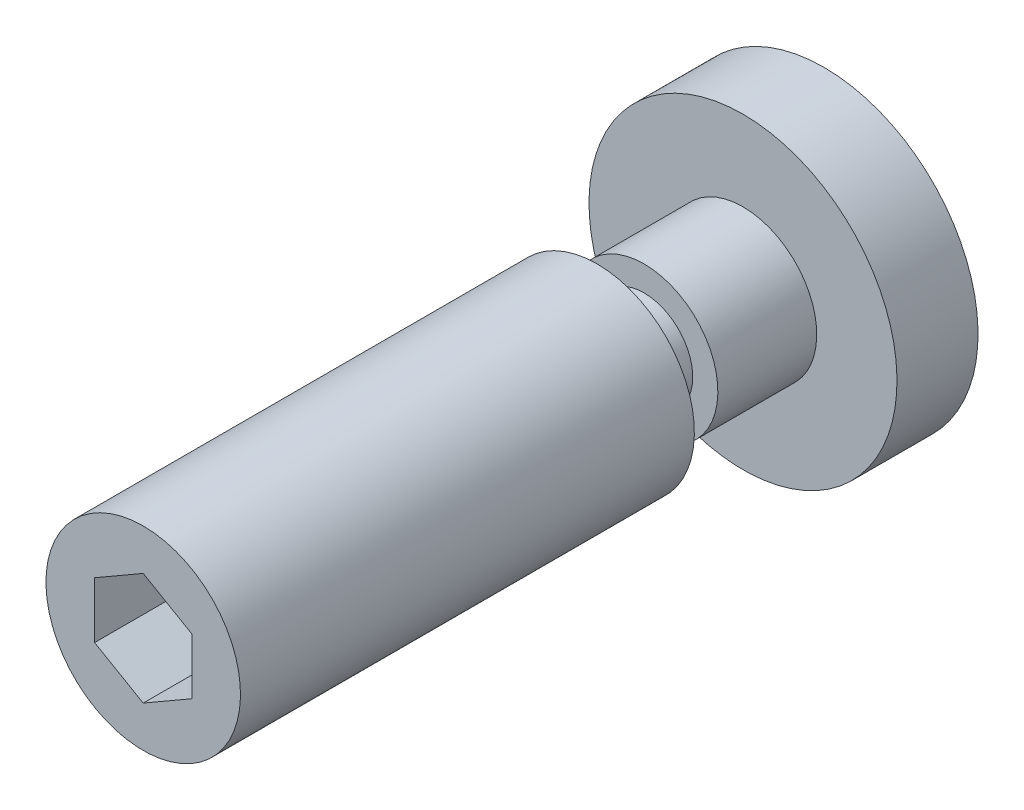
ISO-10303-21;
HEADER;
FILE_DESCRIPTION(('STEP AP214'),'2;1');
FILE_NAME('part.step','',(''),(''),'','','');
FILE_SCHEMA(('AUTOMOTIVE_DESIGN { 1 0 10303 214 1 1 1 1 }'));
ENDSEC;
DATA;
#1=APPLICATION_CONTEXT('core data for automotive mechanical design processes');
#2=APPLICATION_PROTOCOL_DEFINITION('international standard','automotive_design',2000,#1);
#3=PRODUCT_CONTEXT('',#1,'mechanical');
#4=PRODUCT('Part','Part','',(#3));
#5=PRODUCT_RELATED_PRODUCT_CATEGORY('part','',(#4));
#6=PRODUCT_DEFINITION_FORMATION('','',#4);
#7=PRODUCT_DEFINITION_CONTEXT('part definition',#1,'design');
#8=PRODUCT_DEFINITION('design','',#6,#7);
#9=PRODUCT_DEFINITION_SHAPE('','',#8);
#10=(LENGTH_UNIT() NAMED_UNIT(*) SI_UNIT(.MILLI.,.METRE.));
#11=(NAMED_UNIT(*) PLANE_ANGLE_UNIT() SI_UNIT($,.RADIAN.));
#12=(NAMED_UNIT(*) SI_UNIT($,.STERADIAN.) SOLID_ANGLE_UNIT());
#13=UNCERTAINTY_MEASURE_WITH_UNIT(LENGTH_MEASURE(1.E-05),#10,'distance_accuracy_value','');
#14=(GEOMETRIC_REPRESENTATION_CONTEXT(3) GLOBAL_UNCERTAINTY_ASSIGNED_CONTEXT((#13)) GLOBAL_UNIT_ASSIGNED_CONTEXT((#10,
#11,#12)) REPRESENTATION_CONTEXT('',''));
#15=CARTESIAN_POINT('',(0.,0.,0.));
#16=DIRECTION('',(0.,0.,1.));
#17=DIRECTION('',(1.,0.,0.));
#18=AXIS2_PLACEMENT_3D('',#15,#16,#17);
#19=CARTESIAN_POINT('',(0.,0.,0.));
#20=DIRECTION('',(0.,0.,1.));
#21=DIRECTION('',(0.,1.,0.));
#22=AXIS2_PLACEMENT_3D('',#19,#20,#21);
#23=PLANE('',#22);
#24=CARTESIAN_POINT('',(0.,0.,0.));
#25=DIRECTION('',(0.,0.,1.));
#26=DIRECTION('',(0.,1.,0.));
#27=AXIS2_PLACEMENT_3D('',#24,#25,#26);
#28=CIRCLE('',#27,9.5);
#29=CARTESIAN_POINT('',(0.,9.5,0.));
#30=VERTEX_POINT('',#29);
#31=EDGE_CURVE('E9',#30,#30,#28,.T.);
#32=ORIENTED_EDGE('',*,*,#31,.F.);
#33=EDGE_LOOP('',(#32));
#34=FACE_BOUND('',#33,.T.);
#35=ADVANCED_FACE('F14',(#34),#23,.F.);
#36=CARTESIAN_POINT('',(0.,0.,40.));
#37=DIRECTION('',(0.,0.,1.));
#38=DIRECTION('',(0.,1.,0.));
#39=AXIS2_PLACEMENT_3D('',#36,#37,#38);
#40=CYLINDRICAL_SURFACE('',#39,9.5);
#41=CARTESIAN_POINT('',(0.,0.,5.));
#42=DIRECTION('',(0.,0.,1.));
#43=DIRECTION('',(0.,1.,0.));
#44=AXIS2_PLACEMENT_3D('',#41,#42,#43);
#45=CIRCLE('',#44,9.5);
#46=CARTESIAN_POINT('',(0.,9.5,5.));
#47=VERTEX_POINT('',#46);
#48=EDGE_CURVE('E21',#47,#47,#45,.T.);
#49=ORIENTED_EDGE('',*,*,#48,.F.);
#50=EDGE_LOOP('',(#49));
#51=FACE_BOUND('',#50,.T.);
#52=ORIENTED_EDGE('',*,*,#31,.T.);
#53=EDGE_LOOP('',(#52));
#54=FACE_BOUND('',#53,.T.);
#55=ADVANCED_FACE('F142',(#51,#54),#40,.T.);
#56=CARTESIAN_POINT('',(0.,-9.5,5.));
#57=DIRECTION('',(0.,0.,-1.));
#58=DIRECTION('',(0.,-1.,0.));
#59=AXIS2_PLACEMENT_3D('',#56,#57,#58);
#60=PLANE('',#59);
#61=CARTESIAN_POINT('',(0.,0.,5.));
#62=DIRECTION('',(0.,0.,1.));
#63=DIRECTION('',(0.,1.,0.));
#64=AXIS2_PLACEMENT_3D('',#61,#62,#63);
#65=CIRCLE('',#64,4.55);
#66=CARTESIAN_POINT('',(0.,4.55,5.));
#67=VERTEX_POINT('',#66);
#68=EDGE_CURVE('E135',#67,#67,#65,.T.);
#69=ORIENTED_EDGE('',*,*,#68,.F.);
#70=EDGE_LOOP('',(#69));
#71=FACE_BOUND('',#70,.T.);
#72=ORIENTED_EDGE('',*,*,#48,.T.);
#73=EDGE_LOOP('',(#72));
#74=FACE_BOUND('',#73,.T.);
#75=ADVANCED_FACE('F140',(#71,#74),#60,.F.);
#76=CARTESIAN_POINT('',(0.,0.,40.));
#77=DIRECTION('',(0.,0.,1.));
#78=DIRECTION('',(0.,1.,0.));
#79=AXIS2_PLACEMENT_3D('',#76,#77,#78);
#80=CYLINDRICAL_SURFACE('',#79,4.55);
#81=CARTESIAN_POINT('',(0.,0.,11.1));
#82=DIRECTION('',(0.,0.,1.));
#83=DIRECTION('',(0.,1.,0.));
#84=AXIS2_PLACEMENT_3D('',#81,#82,#83);
#85=CIRCLE('',#84,4.55);
#86=CARTESIAN_POINT('',(0.,4.55,11.1));
#87=VERTEX_POINT('',#86);
#88=EDGE_CURVE('E132',#87,#87,#85,.T.);
#89=ORIENTED_EDGE('',*,*,#88,.F.);
#90=EDGE_LOOP('',(#89));
#91=FACE_BOUND('',#90,.T.);
#92=ORIENTED_EDGE('',*,*,#68,.T.);
#93=EDGE_LOOP('',(#92));
#94=FACE_BOUND('',#93,.T.);
#95=ADVANCED_FACE('F165',(#91,#94),#80,.T.);
#96=CARTESIAN_POINT('',(0.,-4.55,11.1));
#97=DIRECTION('',(0.,0.,-1.));
#98=DIRECTION('',(0.,-1.,0.));
#99=AXIS2_PLACEMENT_3D('',#96,#97,#98);
#100=PLANE('',#99);
#101=CARTESIAN_POINT('',(0.,0.,11.1));
#102=DIRECTION('',(0.,0.,1.));
#103=DIRECTION('',(0.,1.,0.));
#104=AXIS2_PLACEMENT_3D('',#101,#102,#103);
#105=CIRCLE('',#104,3.);
#106=CARTESIAN_POINT('',(0.,3.,11.1));
#107=VERTEX_POINT('',#106);
#108=EDGE_CURVE('E129',#107,#107,#105,.T.);
#109=ORIENTED_EDGE('',*,*,#108,.F.);
#110=EDGE_LOOP('',(#109));
#111=FACE_BOUND('',#110,.T.);
#112=ORIENTED_EDGE('',*,*,#88,.T.);
#113=EDGE_LOOP('',(#112));
#114=FACE_BOUND('',#113,.T.);
#115=ADVANCED_FACE('F174',(#111,#114),#100,.F.);
#116=CARTESIAN_POINT('',(0.,0.,40.));
#117=DIRECTION('',(0.,0.,1.));
#118=DIRECTION('',(0.,1.,0.));
#119=AXIS2_PLACEMENT_3D('',#116,#117,#118);
#120=CYLINDRICAL_SURFACE('',#119,3.);
#121=CARTESIAN_POINT('',(0.,0.,14.));
#122=DIRECTION('',(0.,0.,1.));
#123=DIRECTION('',(0.,1.,0.));
#124=AXIS2_PLACEMENT_3D('',#121,#122,#123);
#125=CIRCLE('',#124,3.);
#126=CARTESIAN_POINT('',(0.,3.,14.));
#127=VERTEX_POINT('',#126);
#128=EDGE_CURVE('E126',#127,#127,#125,.T.);
#129=ORIENTED_EDGE('',*,*,#128,.F.);
#130=EDGE_LOOP('',(#129));
#131=FACE_BOUND('',#130,.T.);
#132=ORIENTED_EDGE('',*,*,#108,.T.);
#133=EDGE_LOOP('',(#132));
#134=FACE_BOUND('',#133,.T.);
#135=ADVANCED_FACE('F183',(#131,#134),#120,.T.);
#136=CARTESIAN_POINT('',(0.,-3.,14.));
#137=DIRECTION('',(0.,0.,1.));
#138=DIRECTION('',(0.,1.,0.));
#139=AXIS2_PLACEMENT_3D('',#136,#137,#138);
#140=PLANE('',#139);
#141=CARTESIAN_POINT('',(0.,0.,14.));
#142=DIRECTION('',(0.,0.,1.));
#143=DIRECTION('',(0.,1.,0.));
#144=AXIS2_PLACEMENT_3D('',#141,#142,#143);
#145=CIRCLE('',#144,6.);
#146=CARTESIAN_POINT('',(0.,6.,14.));
#147=VERTEX_POINT('',#146);
#148=EDGE_CURVE('E123',#147,#147,#145,.T.);
#149=ORIENTED_EDGE('',*,*,#148,.F.);
#150=EDGE_LOOP('',(#149));
#151=FACE_BOUND('',#150,.T.);
#152=ORIENTED_EDGE('',*,*,#128,.T.);
#153=EDGE_LOOP('',(#152));
#154=FACE_BOUND('',#153,.T.);
#155=ADVANCED_FACE('F192',(#151,#154),#140,.F.);
#156=CARTESIAN_POINT('',(0.,0.,40.));
#157=DIRECTION('',(0.,0.,1.));
#158=DIRECTION('',(0.,1.,0.));
#159=AXIS2_PLACEMENT_3D('',#156,#157,#158);
#160=CYLINDRICAL_SURFACE('',#159,6.);
#161=CARTESIAN_POINT('',(0.,0.,42.));
#162=DIRECTION('',(0.,0.,1.));
#163=DIRECTION('',(0.,1.,0.));
#164=AXIS2_PLACEMENT_3D('',#161,#162,#163);
#165=CIRCLE('',#164,6.);
#166=CARTESIAN_POINT('',(0.,6.,42.));
#167=VERTEX_POINT('',#166);
#168=EDGE_CURVE('E115',#167,#167,#165,.T.);
#169=ORIENTED_EDGE('',*,*,#168,.F.);
#170=EDGE_LOOP('',(#169));
#171=FACE_BOUND('',#170,.T.);
#172=ORIENTED_EDGE('',*,*,#148,.T.);
#173=EDGE_LOOP('',(#172));
#174=FACE_BOUND('',#173,.T.);
#175=ADVANCED_FACE('F201',(#171,#174),#160,.T.);
#176=CARTESIAN_POINT('',(0.,-6.,42.));
#177=DIRECTION('',(0.,0.,-1.));
#178=DIRECTION('',(0.,-1.,0.));
#179=AXIS2_PLACEMENT_3D('',#176,#177,#178);
#180=PLANE('',#179);
#181=DIRECTION('',(-0.866025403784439,-0.5,0.));
#182=VECTOR('',#181,1.);
#183=CARTESIAN_POINT('',(0.,3.46410161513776,42.));
#184=LINE('',#183,#182);
#185=CARTESIAN_POINT('',(0.,3.46410161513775,42.));
#186=VERTEX_POINT('',#185);
#187=CARTESIAN_POINT('',(-3.,1.73205080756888,42.));
#188=VERTEX_POINT('',#187);
#189=EDGE_CURVE('E102',#186,#188,#184,.T.);
#190=ORIENTED_EDGE('',*,*,#189,.F.);
#191=DIRECTION('',(-0.866025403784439,0.5,0.));
#192=VECTOR('',#191,1.);
#193=CARTESIAN_POINT('',(3.,1.73205080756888,42.));
#194=LINE('',#193,#192);
#195=CARTESIAN_POINT('',(3.,1.73205080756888,42.));
#196=VERTEX_POINT('',#195);
#197=EDGE_CURVE('E28',#196,#186,#194,.T.);
#198=ORIENTED_EDGE('',*,*,#197,.F.);
#199=DIRECTION('',(0.,1.,0.));
#200=VECTOR('',#199,1.);
#201=CARTESIAN_POINT('',(3.,-1.73205080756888,42.));
#202=LINE('',#201,#200);
#203=CARTESIAN_POINT('',(3.,-1.73205080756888,42.));
#204=VERTEX_POINT('',#203);
#205=EDGE_CURVE('E111',#204,#196,#202,.T.);
#206=ORIENTED_EDGE('',*,*,#205,.F.);
#207=DIRECTION('',(0.866025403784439,0.5,0.));
#208=VECTOR('',#207,1.);
#209=CARTESIAN_POINT('',(0.,-3.46410161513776,42.));
#210=LINE('',#209,#208);
#211=CARTESIAN_POINT('',(0.,-3.46410161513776,42.));
#212=VERTEX_POINT('',#211);
#213=EDGE_CURVE('E109',#212,#204,#210,.T.);
#214=ORIENTED_EDGE('',*,*,#213,.F.);
#215=DIRECTION('',(0.866025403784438,-0.5,0.));
#216=VECTOR('',#215,1.);
#217=CARTESIAN_POINT('',(-3.,-1.73205080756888,42.));
#218=LINE('',#217,#216);
#219=CARTESIAN_POINT('',(-3.,-1.73205080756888,42.));
#220=VERTEX_POINT('',#219);
#221=EDGE_CURVE('E76',#220,#212,#218,.T.);
#222=ORIENTED_EDGE('',*,*,#221,.F.);
#223=DIRECTION('',(0.,-1.,0.));
#224=VECTOR('',#223,1.);
#225=CARTESIAN_POINT('',(-3.,1.73205080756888,42.));
#226=LINE('',#225,#224);
#227=EDGE_CURVE('E105',#188,#220,#226,.T.);
#228=ORIENTED_EDGE('',*,*,#227,.F.);
#229=EDGE_LOOP('',(#190,#198,#206,#214,#222,#228));
#230=FACE_BOUND('',#229,.T.);
#231=ORIENTED_EDGE('',*,*,#168,.T.);
#232=EDGE_LOOP('',(#231));
#233=FACE_BOUND('',#232,.T.);
#234=ADVANCED_FACE('F210',(#230,#233),#180,.F.);
#235=CARTESIAN_POINT('',(3.,1.73205080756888,34.));
#236=DIRECTION('',(0.5,0.866025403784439,0.));
#237=DIRECTION('',(-0.866025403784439,0.5,0.));
#238=AXIS2_PLACEMENT_3D('',#235,#236,#237);
#239=PLANE('',#238);
#240=ORIENTED_EDGE('',*,*,#197,.T.);
#241=DIRECTION('',(0.,0.,1.));
#242=VECTOR('',#241,1.);
#243=CARTESIAN_POINT('',(0.,3.46410161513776,34.));
#244=LINE('',#243,#242);
#245=CARTESIAN_POINT('',(0.,3.46410161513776,34.));
#246=VERTEX_POINT('',#245);
#247=EDGE_CURVE('E58',#246,#186,#244,.T.);
#248=ORIENTED_EDGE('',*,*,#247,.F.);
#249=DIRECTION('',(-0.866025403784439,0.5,0.));
#250=VECTOR('',#249,1.);
#251=CARTESIAN_POINT('',(3.,1.73205080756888,34.));
#252=LINE('',#251,#250);
#253=CARTESIAN_POINT('',(3.,1.73205080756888,34.));
#254=VERTEX_POINT('',#253);
#255=EDGE_CURVE('E113',#254,#246,#252,.T.);
#256=ORIENTED_EDGE('',*,*,#255,.F.);
#257=DIRECTION('',(0.,0.,1.));
#258=VECTOR('',#257,1.);
#259=CARTESIAN_POINT('',(3.,1.73205080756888,34.));
#260=LINE('',#259,#258);
#261=EDGE_CURVE('E36',#254,#196,#260,.T.);
#262=ORIENTED_EDGE('',*,*,#261,.T.);
#263=EDGE_LOOP('',(#240,#248,#256,#262));
#264=FACE_BOUND('',#263,.T.);
#265=ADVANCED_FACE('F219',(#264),#239,.F.);
#266=CARTESIAN_POINT('',(3.,-1.73205080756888,34.));
#267=DIRECTION('',(1.,0.,0.));
#268=DIRECTION('',(0.,1.,0.));
#269=AXIS2_PLACEMENT_3D('',#266,#267,#268);
#270=PLANE('',#269);
#271=ORIENTED_EDGE('',*,*,#205,.T.);
#272=ORIENTED_EDGE('',*,*,#261,.F.);
#273=DIRECTION('',(0.,1.,0.));
#274=VECTOR('',#273,1.);
#275=CARTESIAN_POINT('',(3.,-1.73205080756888,34.));
#276=LINE('',#275,#274);
#277=CARTESIAN_POINT('',(3.,-1.73205080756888,34.));
#278=VERTEX_POINT('',#277);
#279=EDGE_CURVE('E88',#278,#254,#276,.T.);
#280=ORIENTED_EDGE('',*,*,#279,.F.);
#281=DIRECTION('',(0.,0.,1.));
#282=VECTOR('',#281,1.);
#283=CARTESIAN_POINT('',(3.,-1.73205080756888,34.));
#284=LINE('',#283,#282);
#285=EDGE_CURVE('E80',#278,#204,#284,.T.);
#286=ORIENTED_EDGE('',*,*,#285,.T.);
#287=EDGE_LOOP('',(#271,#272,#280,#286));
#288=FACE_BOUND('',#287,.T.);
#289=ADVANCED_FACE('F228',(#288),#270,.F.);
#290=CARTESIAN_POINT('',(0.,-3.46410161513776,34.));
#291=DIRECTION('',(0.5,-0.866025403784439,0.));
#292=DIRECTION('',(0.866025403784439,0.5,0.));
#293=AXIS2_PLACEMENT_3D('',#290,#291,#292);
#294=PLANE('',#293);
#295=ORIENTED_EDGE('',*,*,#213,.T.);
#296=ORIENTED_EDGE('',*,*,#285,.F.);
#297=DIRECTION('',(0.866025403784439,0.5,0.));
#298=VECTOR('',#297,1.);
#299=CARTESIAN_POINT('',(0.,-3.46410161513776,34.));
#300=LINE('',#299,#298);
#301=CARTESIAN_POINT('',(0.,-3.46410161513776,34.));
#302=VERTEX_POINT('',#301);
#303=EDGE_CURVE('E84',#302,#278,#300,.T.);
#304=ORIENTED_EDGE('',*,*,#303,.F.);
#305=DIRECTION('',(0.,0.,1.));
#306=VECTOR('',#305,1.);
#307=CARTESIAN_POINT('',(0.,-3.46410161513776,34.));
#308=LINE('',#307,#306);
#309=EDGE_CURVE('E69',#302,#212,#308,.T.);
#310=ORIENTED_EDGE('',*,*,#309,.T.);
#311=EDGE_LOOP('',(#295,#296,#304,#310));
#312=FACE_BOUND('',#311,.T.);
#313=ADVANCED_FACE('F85',(#312),#294,.F.);
#314=CARTESIAN_POINT('',(-3.,-1.73205080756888,34.));
#315=DIRECTION('',(-0.5,-0.866025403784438,0.));
#316=DIRECTION('',(0.866025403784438,-0.5,0.));
#317=AXIS2_PLACEMENT_3D('',#314,#315,#316);
#318=PLANE('',#317);
#319=ORIENTED_EDGE('',*,*,#221,.T.);
#320=ORIENTED_EDGE('',*,*,#309,.F.);
#321=DIRECTION('',(0.866025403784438,-0.5,0.));
#322=VECTOR('',#321,1.);
#323=CARTESIAN_POINT('',(-3.,-1.73205080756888,34.));
#324=LINE('',#323,#322);
#325=CARTESIAN_POINT('',(-3.,-1.73205080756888,34.));
#326=VERTEX_POINT('',#325);
#327=EDGE_CURVE('E73',#326,#302,#324,.T.);
#328=ORIENTED_EDGE('',*,*,#327,.F.);
#329=DIRECTION('',(0.,0.,1.));
#330=VECTOR('',#329,1.);
#331=CARTESIAN_POINT('',(-3.,-1.73205080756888,34.));
#332=LINE('',#331,#330);
#333=EDGE_CURVE('E81',#326,#220,#332,.T.);
#334=ORIENTED_EDGE('',*,*,#333,.T.);
#335=EDGE_LOOP('',(#319,#320,#328,#334));
#336=FACE_BOUND('',#335,.T.);
#337=ADVANCED_FACE('F71',(#336),#318,.F.);
#338=CARTESIAN_POINT('',(-3.,1.73205080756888,34.));
#339=DIRECTION('',(-1.,0.,0.));
#340=DIRECTION('',(0.,-1.,0.));
#341=AXIS2_PLACEMENT_3D('',#338,#339,#340);
#342=PLANE('',#341);
#343=ORIENTED_EDGE('',*,*,#227,.T.);
#344=ORIENTED_EDGE('',*,*,#333,.F.);
#345=DIRECTION('',(0.,-1.,0.));
#346=VECTOR('',#345,1.);
#347=CARTESIAN_POINT('',(-3.,1.73205080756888,34.));
#348=LINE('',#347,#346);
#349=CARTESIAN_POINT('',(-3.,1.73205080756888,34.));
#350=VERTEX_POINT('',#349);
#351=EDGE_CURVE('E94',#350,#326,#348,.T.);
#352=ORIENTED_EDGE('',*,*,#351,.F.);
#353=DIRECTION('',(0.,0.,1.));
#354=VECTOR('',#353,1.);
#355=CARTESIAN_POINT('',(-3.,1.73205080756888,34.));
#356=LINE('',#355,#354);
#357=EDGE_CURVE('E118',#350,#188,#356,.T.);
#358=ORIENTED_EDGE('',*,*,#357,.T.);
#359=EDGE_LOOP('',(#343,#344,#352,#358));
#360=FACE_BOUND('',#359,.T.);
#361=ADVANCED_FACE('F250',(#360),#342,.F.);
#362=CARTESIAN_POINT('',(0.,3.46410161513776,34.));
#363=DIRECTION('',(-0.5,0.866025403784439,0.));
#364=DIRECTION('',(-0.866025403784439,-0.5,0.));
#365=AXIS2_PLACEMENT_3D('',#362,#363,#364);
#366=PLANE('',#365);
#367=ORIENTED_EDGE('',*,*,#189,.T.);
#368=ORIENTED_EDGE('',*,*,#357,.F.);
#369=DIRECTION('',(-0.866025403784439,-0.5,0.));
#370=VECTOR('',#369,1.);
#371=CARTESIAN_POINT('',(0.,3.46410161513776,34.));
#372=LINE('',#371,#370);
#373=EDGE_CURVE('E96',#246,#350,#372,.T.);
#374=ORIENTED_EDGE('',*,*,#373,.F.);
#375=ORIENTED_EDGE('',*,*,#247,.T.);
#376=EDGE_LOOP('',(#367,#368,#374,#375));
#377=FACE_BOUND('',#376,.T.);
#378=ADVANCED_FACE('F258',(#377),#366,.F.);
#379=CARTESIAN_POINT('',(0.,3.46410161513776,34.));
#380=DIRECTION('',(0.,0.,1.));
#381=DIRECTION('',(1.,0.,0.));
#382=AXIS2_PLACEMENT_3D('',#379,#380,#381);
#383=PLANE('',#382);
#384=ORIENTED_EDGE('',*,*,#255,.T.);
#385=ORIENTED_EDGE('',*,*,#373,.T.);
#386=ORIENTED_EDGE('',*,*,#351,.T.);
#387=ORIENTED_EDGE('',*,*,#327,.T.);
#388=ORIENTED_EDGE('',*,*,#303,.T.);
#389=ORIENTED_EDGE('',*,*,#279,.T.);
#390=EDGE_LOOP('',(#384,#385,#386,#387,#388,#389));
#391=FACE_BOUND('',#390,.T.);
#392=ADVANCED_FACE('F91',(#391),#383,.T.);
#393=CLOSED_SHELL('',(#35,#55,#75,#95,#115,#135,#155,#175,#234,#265,#289,#313,#337,#361,#378,#392));
#394=MANIFOLD_SOLID_BREP('B1',#393);
#395=ADVANCED_BREP_SHAPE_REPRESENTATION('',(#18,#394),#14);
#396=SHAPE_DEFINITION_REPRESENTATION(#9,#395);
ENDSEC;
END-ISO-10303-21;
